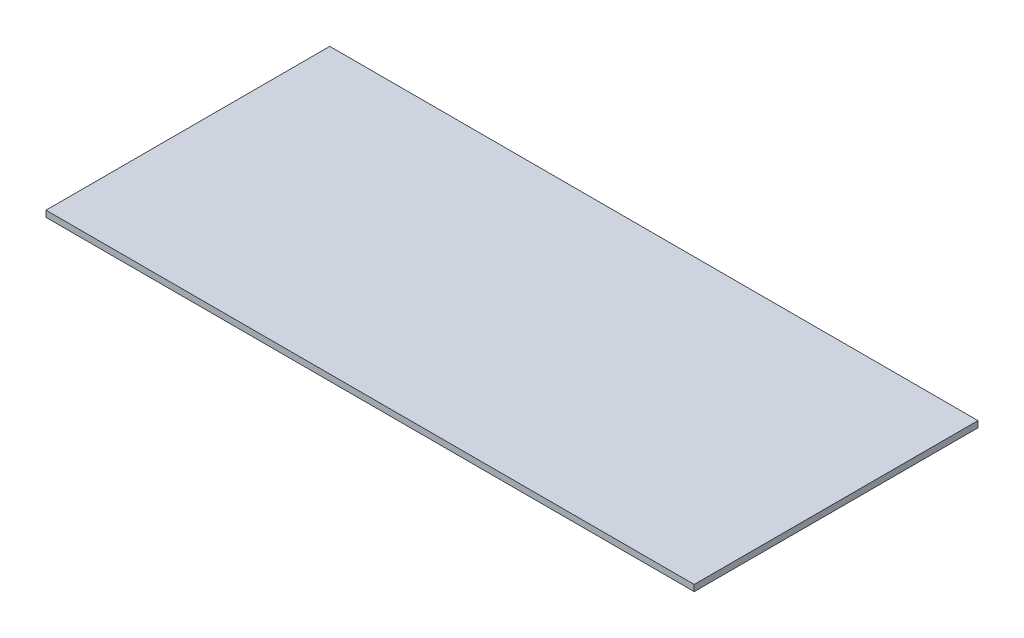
ISO-10303-21;
HEADER;
FILE_DESCRIPTION(('STEP AP214'),'2;1');
FILE_NAME('part.step','',(''),(''),'','','');
FILE_SCHEMA(('AUTOMOTIVE_DESIGN { 1 0 10303 214 1 1 1 1 }'));
ENDSEC;
DATA;
#1=APPLICATION_CONTEXT('core data for automotive mechanical design processes');
#2=APPLICATION_PROTOCOL_DEFINITION('international standard','automotive_design',2000,#1);
#3=PRODUCT_CONTEXT('',#1,'mechanical');
#4=PRODUCT('Part','Part','',(#3));
#5=PRODUCT_RELATED_PRODUCT_CATEGORY('part','',(#4));
#6=PRODUCT_DEFINITION_FORMATION('','',#4);
#7=PRODUCT_DEFINITION_CONTEXT('part definition',#1,'design');
#8=PRODUCT_DEFINITION('design','',#6,#7);
#9=PRODUCT_DEFINITION_SHAPE('','',#8);
#10=(LENGTH_UNIT() NAMED_UNIT(*) SI_UNIT(.MILLI.,.METRE.));
#11=(NAMED_UNIT(*) PLANE_ANGLE_UNIT() SI_UNIT($,.RADIAN.));
#12=(NAMED_UNIT(*) SI_UNIT($,.STERADIAN.) SOLID_ANGLE_UNIT());
#13=UNCERTAINTY_MEASURE_WITH_UNIT(LENGTH_MEASURE(1.E-05),#10,'distance_accuracy_value','');
#14=(GEOMETRIC_REPRESENTATION_CONTEXT(3) GLOBAL_UNCERTAINTY_ASSIGNED_CONTEXT((#13)) GLOBAL_UNIT_ASSIGNED_CONTEXT((#10,
#11,#12)) REPRESENTATION_CONTEXT('',''));
#15=CARTESIAN_POINT('',(0.,0.,0.));
#16=DIRECTION('',(0.,0.,1.));
#17=DIRECTION('',(1.,0.,0.));
#18=AXIS2_PLACEMENT_3D('',#15,#16,#17);
#19=CARTESIAN_POINT('',(77.6682464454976,-1.5,34.));
#20=DIRECTION('',(1.,0.,0.));
#21=DIRECTION('',(0.,0.,-1.));
#22=AXIS2_PLACEMENT_3D('',#19,#20,#21);
#23=PLANE('',#22);
#24=DIRECTION('',(0.,0.,-1.));
#25=VECTOR('',#24,1.);
#26=CARTESIAN_POINT('',(77.6682464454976,0.,34.));
#27=LINE('',#26,#25);
#28=CARTESIAN_POINT('',(77.6682464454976,0.,34.));
#29=VERTEX_POINT('',#28);
#30=CARTESIAN_POINT('',(77.6682464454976,0.,-34.));
#31=VERTEX_POINT('',#30);
#32=EDGE_CURVE('E104',#29,#31,#27,.T.);
#33=ORIENTED_EDGE('',*,*,#32,.F.);
#34=DIRECTION('',(0.,1.,0.));
#35=VECTOR('',#34,1.);
#36=CARTESIAN_POINT('',(77.6682464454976,-1.5,34.));
#37=LINE('',#36,#35);
#38=CARTESIAN_POINT('',(77.6682464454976,-1.5,34.));
#39=VERTEX_POINT('',#38);
#40=EDGE_CURVE('E11',#39,#29,#37,.T.);
#41=ORIENTED_EDGE('',*,*,#40,.F.);
#42=DIRECTION('',(0.,0.,-1.));
#43=VECTOR('',#42,1.);
#44=CARTESIAN_POINT('',(77.6682464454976,-1.5,34.));
#45=LINE('',#44,#43);
#46=CARTESIAN_POINT('',(77.6682464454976,-1.5,-34.));
#47=VERTEX_POINT('',#46);
#48=EDGE_CURVE('E98',#39,#47,#45,.T.);
#49=ORIENTED_EDGE('',*,*,#48,.T.);
#50=DIRECTION('',(0.,1.,0.));
#51=VECTOR('',#50,1.);
#52=CARTESIAN_POINT('',(77.6682464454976,-1.5,-34.));
#53=LINE('',#52,#51);
#54=EDGE_CURVE('E43',#47,#31,#53,.T.);
#55=ORIENTED_EDGE('',*,*,#54,.T.);
#56=EDGE_LOOP('',(#33,#41,#49,#55));
#57=FACE_BOUND('',#56,.T.);
#58=ADVANCED_FACE('F40',(#57),#23,.T.);
#59=CARTESIAN_POINT('',(-77.6682464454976,-1.5,34.));
#60=DIRECTION('',(0.,0.,1.));
#61=DIRECTION('',(1.,0.,0.));
#62=AXIS2_PLACEMENT_3D('',#59,#60,#61);
#63=PLANE('',#62);
#64=DIRECTION('',(1.,0.,0.));
#65=VECTOR('',#64,1.);
#66=CARTESIAN_POINT('',(-77.6682464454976,0.,34.));
#67=LINE('',#66,#65);
#68=CARTESIAN_POINT('',(-77.6682464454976,0.,34.));
#69=VERTEX_POINT('',#68);
#70=EDGE_CURVE('E100',#69,#29,#67,.T.);
#71=ORIENTED_EDGE('',*,*,#70,.F.);
#72=DIRECTION('',(0.,1.,0.));
#73=VECTOR('',#72,1.);
#74=CARTESIAN_POINT('',(-77.6682464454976,-1.5,34.));
#75=LINE('',#74,#73);
#76=CARTESIAN_POINT('',(-77.6682464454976,-1.5,34.));
#77=VERTEX_POINT('',#76);
#78=EDGE_CURVE('E49',#77,#69,#75,.T.);
#79=ORIENTED_EDGE('',*,*,#78,.F.);
#80=DIRECTION('',(1.,0.,0.));
#81=VECTOR('',#80,1.);
#82=CARTESIAN_POINT('',(-77.6682464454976,-1.5,34.));
#83=LINE('',#82,#81);
#84=EDGE_CURVE('E95',#77,#39,#83,.T.);
#85=ORIENTED_EDGE('',*,*,#84,.T.);
#86=ORIENTED_EDGE('',*,*,#40,.T.);
#87=EDGE_LOOP('',(#71,#79,#85,#86));
#88=FACE_BOUND('',#87,.T.);
#89=ADVANCED_FACE('F114',(#88),#63,.T.);
#90=CARTESIAN_POINT('',(-77.6682464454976,-1.5,34.));
#91=DIRECTION('',(-1.,0.,0.));
#92=DIRECTION('',(0.,0.,1.));
#93=AXIS2_PLACEMENT_3D('',#90,#91,#92);
#94=PLANE('',#93);
#95=DIRECTION('',(0.,0.,1.));
#96=VECTOR('',#95,1.);
#97=CARTESIAN_POINT('',(-77.6682464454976,0.,34.));
#98=LINE('',#97,#96);
#99=CARTESIAN_POINT('',(-77.6682464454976,0.,-34.));
#100=VERTEX_POINT('',#99);
#101=EDGE_CURVE('E90',#100,#69,#98,.T.);
#102=ORIENTED_EDGE('',*,*,#101,.F.);
#103=DIRECTION('',(0.,1.,0.));
#104=VECTOR('',#103,1.);
#105=CARTESIAN_POINT('',(-77.6682464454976,-1.5,-34.));
#106=LINE('',#105,#104);
#107=CARTESIAN_POINT('',(-77.6682464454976,-1.5,-34.));
#108=VERTEX_POINT('',#107);
#109=EDGE_CURVE('E85',#108,#100,#106,.T.);
#110=ORIENTED_EDGE('',*,*,#109,.F.);
#111=DIRECTION('',(0.,0.,1.));
#112=VECTOR('',#111,1.);
#113=CARTESIAN_POINT('',(-77.6682464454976,-1.5,34.));
#114=LINE('',#113,#112);
#115=EDGE_CURVE('E88',#108,#77,#114,.T.);
#116=ORIENTED_EDGE('',*,*,#115,.T.);
#117=ORIENTED_EDGE('',*,*,#78,.T.);
#118=EDGE_LOOP('',(#102,#110,#116,#117));
#119=FACE_BOUND('',#118,.T.);
#120=ADVANCED_FACE('F87',(#119),#94,.T.);
#121=CARTESIAN_POINT('',(-77.6682464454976,-1.5,-34.));
#122=DIRECTION('',(0.,0.,-1.));
#123=DIRECTION('',(-1.,0.,0.));
#124=AXIS2_PLACEMENT_3D('',#121,#122,#123);
#125=PLANE('',#124);
#126=DIRECTION('',(-1.,0.,0.));
#127=VECTOR('',#126,1.);
#128=CARTESIAN_POINT('',(-77.6682464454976,0.,-34.));
#129=LINE('',#128,#127);
#130=EDGE_CURVE('E107',#31,#100,#129,.T.);
#131=ORIENTED_EDGE('',*,*,#130,.F.);
#132=ORIENTED_EDGE('',*,*,#54,.F.);
#133=DIRECTION('',(-1.,0.,0.));
#134=VECTOR('',#133,1.);
#135=CARTESIAN_POINT('',(-77.6682464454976,-1.5,-34.));
#136=LINE('',#135,#134);
#137=EDGE_CURVE('E94',#47,#108,#136,.T.);
#138=ORIENTED_EDGE('',*,*,#137,.T.);
#139=ORIENTED_EDGE('',*,*,#109,.T.);
#140=EDGE_LOOP('',(#131,#132,#138,#139));
#141=FACE_BOUND('',#140,.T.);
#142=ADVANCED_FACE('F97',(#141),#125,.T.);
#143=CARTESIAN_POINT('',(0.,-1.5,0.));
#144=DIRECTION('',(0.,-1.,0.));
#145=DIRECTION('',(0.,0.,-1.));
#146=AXIS2_PLACEMENT_3D('',#143,#144,#145);
#147=PLANE('',#146);
#148=ORIENTED_EDGE('',*,*,#48,.F.);
#149=ORIENTED_EDGE('',*,*,#84,.F.);
#150=ORIENTED_EDGE('',*,*,#115,.F.);
#151=ORIENTED_EDGE('',*,*,#137,.F.);
#152=EDGE_LOOP('',(#148,#149,#150,#151));
#153=FACE_BOUND('',#152,.T.);
#154=ADVANCED_FACE('F93',(#153),#147,.T.);
#155=CARTESIAN_POINT('',(0.,0.,0.));
#156=DIRECTION('',(0.,-1.,0.));
#157=DIRECTION('',(0.,0.,-1.));
#158=AXIS2_PLACEMENT_3D('',#155,#156,#157);
#159=PLANE('',#158);
#160=ORIENTED_EDGE('',*,*,#32,.T.);
#161=ORIENTED_EDGE('',*,*,#130,.T.);
#162=ORIENTED_EDGE('',*,*,#101,.T.);
#163=ORIENTED_EDGE('',*,*,#70,.T.);
#164=EDGE_LOOP('',(#160,#161,#162,#163));
#165=FACE_BOUND('',#164,.T.);
#166=ADVANCED_FACE('F113',(#165),#159,.F.);
#167=CLOSED_SHELL('',(#58,#89,#120,#142,#154,#166));
#168=MANIFOLD_SOLID_BREP('B2',#167);
#169=ADVANCED_BREP_SHAPE_REPRESENTATION('',(#18,#168),#14);
#170=SHAPE_DEFINITION_REPRESENTATION(#9,#169);
ENDSEC;
END-ISO-10303-21;
